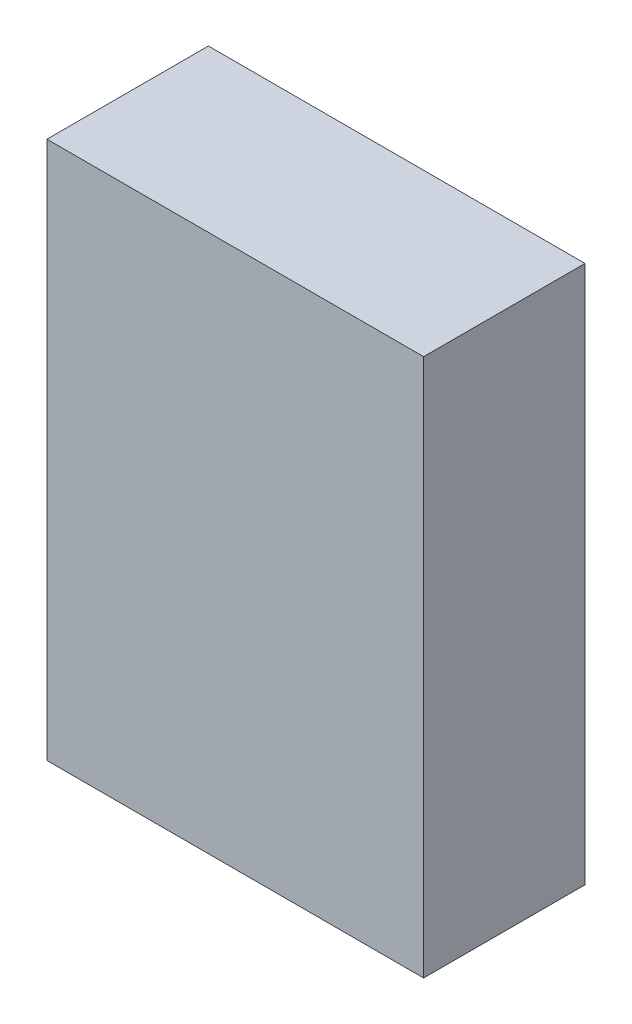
from build123d import *

# Parameters (mm, degrees)
SKETCH1_W           = 88.9
SKETCH1_H           = 38.1
BOSS_EXTRUDE1_DEPTH = 127


with BuildPart() as part:
    # Sketch1 → Boss-Extrude1 (new body)
    with BuildSketch(Plane(origin=(0, 0, 0), x_dir=(1, 0, 0), z_dir=(0, 1, 0))):
        Rectangle(SKETCH1_W, SKETCH1_H)
    extrude(amount=BOSS_EXTRUDE1_DEPTH)


solid = part.part
